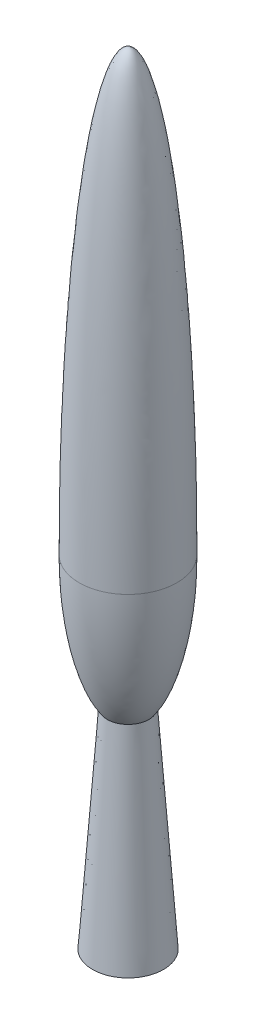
ISO-10303-21;
HEADER;
FILE_DESCRIPTION(('STEP AP214'),'2;1');
FILE_NAME('part.step','',(''),(''),'','','');
FILE_SCHEMA(('AUTOMOTIVE_DESIGN { 1 0 10303 214 1 1 1 1 }'));
ENDSEC;
DATA;
#1=APPLICATION_CONTEXT('core data for automotive mechanical design processes');
#2=APPLICATION_PROTOCOL_DEFINITION('international standard','automotive_design',2000,#1);
#3=PRODUCT_CONTEXT('',#1,'mechanical');
#4=PRODUCT('Part','Part','',(#3));
#5=PRODUCT_RELATED_PRODUCT_CATEGORY('part','',(#4));
#6=PRODUCT_DEFINITION_FORMATION('','',#4);
#7=PRODUCT_DEFINITION_CONTEXT('part definition',#1,'design');
#8=PRODUCT_DEFINITION('design','',#6,#7);
#9=PRODUCT_DEFINITION_SHAPE('','',#8);
#10=(LENGTH_UNIT() NAMED_UNIT(*) SI_UNIT(.MILLI.,.METRE.));
#11=(NAMED_UNIT(*) PLANE_ANGLE_UNIT() SI_UNIT($,.RADIAN.));
#12=(NAMED_UNIT(*) SI_UNIT($,.STERADIAN.) SOLID_ANGLE_UNIT());
#13=UNCERTAINTY_MEASURE_WITH_UNIT(LENGTH_MEASURE(1.E-05),#10,'distance_accuracy_value','');
#14=(GEOMETRIC_REPRESENTATION_CONTEXT(3) GLOBAL_UNCERTAINTY_ASSIGNED_CONTEXT((#13)) GLOBAL_UNIT_ASSIGNED_CONTEXT((#10,
#11,#12)) REPRESENTATION_CONTEXT('',''));
#15=CARTESIAN_POINT('',(0.,0.,0.));
#16=DIRECTION('',(0.,0.,1.));
#17=DIRECTION('',(1.,0.,0.));
#18=AXIS2_PLACEMENT_3D('',#15,#16,#17);
#19=CARTESIAN_POINT('',(0.,0.01,0.));
#20=DIRECTION('',(0.,-1.,0.));
#21=DIRECTION('',(0.,0.,-1.));
#22=AXIS2_PLACEMENT_3D('',#19,#20,#21);
#23=CYLINDRICAL_SURFACE('',#22,1000.);
#24=CARTESIAN_POINT('',(0.,0.01,0.));
#25=DIRECTION('',(0.,1.,0.));
#26=DIRECTION('',(0.,0.,1.));
#27=AXIS2_PLACEMENT_3D('',#24,#25,#26);
#28=CIRCLE('',#27,1000.);
#29=CARTESIAN_POINT('',(0.,0.01,-1000.));
#30=VERTEX_POINT('',#29);
#31=EDGE_CURVE('E11',#30,#30,#28,.T.);
#32=CARTESIAN_POINT('',(0.,0.,0.));
#33=DIRECTION('',(0.,1.,0.));
#34=DIRECTION('',(0.,0.,1.));
#35=AXIS2_PLACEMENT_3D('',#32,#33,#34);
#36=CIRCLE('',#35,1000.);
#37=CARTESIAN_POINT('',(0.,0.,-1000.));
#38=VERTEX_POINT('',#37);
#39=EDGE_CURVE('E41',#38,#38,#36,.T.);
#40=CARTESIAN_POINT('',(0.,0.01,-1000.));
#41=CARTESIAN_POINT('',(0.,0.00989583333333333,-1000.));
#42=CARTESIAN_POINT('',(0.,0.00979166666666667,-1000.));
#43=CARTESIAN_POINT('',(0.,0.00958333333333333,-1000.));
#44=CARTESIAN_POINT('',(0.,0.00947916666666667,-1000.));
#45=CARTESIAN_POINT('',(0.,0.00927083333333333,-1000.));
#46=CARTESIAN_POINT('',(0.,0.00916666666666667,-1000.));
#47=CARTESIAN_POINT('',(0.,0.00895833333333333,-1000.));
#48=CARTESIAN_POINT('',(0.,0.00885416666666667,-1000.));
#49=CARTESIAN_POINT('',(0.,0.00864583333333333,-1000.));
#50=CARTESIAN_POINT('',(0.,0.00854166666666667,-1000.));
#51=CARTESIAN_POINT('',(0.,0.00833333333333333,-1000.));
#52=CARTESIAN_POINT('',(0.,0.00822916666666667,-1000.));
#53=CARTESIAN_POINT('',(0.,0.00802083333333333,-1000.));
#54=CARTESIAN_POINT('',(0.,0.00791666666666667,-1000.));
#55=CARTESIAN_POINT('',(0.,0.00770833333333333,-1000.));
#56=CARTESIAN_POINT('',(0.,0.00760416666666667,-1000.));
#57=CARTESIAN_POINT('',(0.,0.00739583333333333,-1000.));
#58=CARTESIAN_POINT('',(0.,0.00729166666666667,-1000.));
#59=CARTESIAN_POINT('',(0.,0.00708333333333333,-1000.));
#60=CARTESIAN_POINT('',(0.,0.00697916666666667,-1000.));
#61=CARTESIAN_POINT('',(0.,0.00677083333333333,-1000.));
#62=CARTESIAN_POINT('',(0.,0.00666666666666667,-1000.));
#63=CARTESIAN_POINT('',(0.,0.00645833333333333,-1000.));
#64=CARTESIAN_POINT('',(0.,0.00635416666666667,-1000.));
#65=CARTESIAN_POINT('',(0.,0.00614583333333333,-1000.));
#66=CARTESIAN_POINT('',(0.,0.00604166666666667,-1000.));
#67=CARTESIAN_POINT('',(0.,0.00583333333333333,-1000.));
#68=CARTESIAN_POINT('',(0.,0.00572916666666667,-1000.));
#69=CARTESIAN_POINT('',(0.,0.00552083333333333,-1000.));
#70=CARTESIAN_POINT('',(0.,0.00541666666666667,-1000.));
#71=CARTESIAN_POINT('',(0.,0.00520833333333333,-1000.));
#72=CARTESIAN_POINT('',(0.,0.00510416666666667,-1000.));
#73=CARTESIAN_POINT('',(0.,0.00489583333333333,-1000.));
#74=CARTESIAN_POINT('',(0.,0.00479166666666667,-1000.));
#75=CARTESIAN_POINT('',(0.,0.00458333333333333,-1000.));
#76=CARTESIAN_POINT('',(0.,0.00447916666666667,-1000.));
#77=CARTESIAN_POINT('',(0.,0.00427083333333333,-1000.));
#78=CARTESIAN_POINT('',(0.,0.00416666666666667,-1000.));
#79=CARTESIAN_POINT('',(0.,0.00395833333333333,-1000.));
#80=CARTESIAN_POINT('',(0.,0.00385416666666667,-1000.));
#81=CARTESIAN_POINT('',(0.,0.00364583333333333,-1000.));
#82=CARTESIAN_POINT('',(0.,0.00354166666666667,-1000.));
#83=CARTESIAN_POINT('',(0.,0.00333333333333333,-1000.));
#84=CARTESIAN_POINT('',(0.,0.00322916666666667,-1000.));
#85=CARTESIAN_POINT('',(0.,0.00302083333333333,-1000.));
#86=CARTESIAN_POINT('',(0.,0.00291666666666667,-1000.));
#87=CARTESIAN_POINT('',(0.,0.00270833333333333,-1000.));
#88=CARTESIAN_POINT('',(0.,0.00260416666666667,-1000.));
#89=CARTESIAN_POINT('',(0.,0.00239583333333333,-1000.));
#90=CARTESIAN_POINT('',(0.,0.00229166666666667,-1000.));
#91=CARTESIAN_POINT('',(0.,0.00208333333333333,-1000.));
#92=CARTESIAN_POINT('',(0.,0.00197916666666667,-1000.));
#93=CARTESIAN_POINT('',(0.,0.00177083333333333,-1000.));
#94=CARTESIAN_POINT('',(0.,0.00166666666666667,-1000.));
#95=CARTESIAN_POINT('',(0.,0.00145833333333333,-1000.));
#96=CARTESIAN_POINT('',(0.,0.00135416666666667,-1000.));
#97=CARTESIAN_POINT('',(0.,0.00114583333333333,-1000.));
#98=CARTESIAN_POINT('',(0.,0.00104166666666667,-1000.));
#99=CARTESIAN_POINT('',(0.,0.000833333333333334,-1000.));
#100=CARTESIAN_POINT('',(0.,0.000729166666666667,-1000.));
#101=CARTESIAN_POINT('',(0.,0.000520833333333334,-1000.));
#102=CARTESIAN_POINT('',(0.,0.000416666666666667,-1000.));
#103=CARTESIAN_POINT('',(0.,0.000208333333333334,-1000.));
#104=CARTESIAN_POINT('',(0.,0.000104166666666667,-1000.));
#105=CARTESIAN_POINT('',(0.,0.,-1000.));
#106=B_SPLINE_CURVE_WITH_KNOTS('',3,(#40,#41,#42,#43,#44,#45,#46,#47,#48,#49,#50,#51,#52,#53,
#54,#55,#56,#57,#58,#59,#60,#61,#62,#63,#64,#65,#66,#67,#68,#69,#70,#71,#72,#73,#74,#75,#76,#77,
#78,#79,#80,#81,#82,#83,#84,#85,#86,#87,#88,#89,#90,#91,#92,#93,#94,#95,#96,#97,#98,#99,#100,
#101,#102,#103,#104,#105),.UNSPECIFIED.,.F.,.F.,(4,2,2,2,2,2,2,2,2,2,2,2,2,2,2,2,2,2,2,2,2,2,2,
2,2,2,2,2,2,2,2,2,4),(0.,0.000312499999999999,0.000624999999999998,0.000937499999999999,0.00125,
0.0015625,0.001875,0.0021875,0.0025,0.0028125,0.003125,0.0034375,0.00375,0.0040625,0.004375,
0.0046875,0.005,0.0053125,0.005625,0.0059375,0.00625,0.0065625,0.006875,0.0071875,0.0075,
0.0078125,0.008125,0.0084375,0.00875,0.0090625,0.009375,0.0096875,0.01),.UNSPECIFIED.);
#107=EDGE_CURVE('BSEAM33',#30,#38,#106,.T.);
#108=ORIENTED_EDGE('',*,*,#31,.F.);
#109=ORIENTED_EDGE('',*,*,#39,.T.);
#110=ORIENTED_EDGE('',*,*,#107,.T.);
#111=ORIENTED_EDGE('',*,*,#107,.F.);
#112=EDGE_LOOP('',(#108,#110,#109,#111));
#113=FACE_BOUND('',#112,.T.);
#114=ADVANCED_FACE('F33',(#113),#23,.T.);
#115=CARTESIAN_POINT('',(0.,0.01,0.));
#116=DIRECTION('',(1.,0.,0.));
#117=DIRECTION('',(0.,1.,0.));
#118=AXIS2_PLACEMENT_3D('',#115,#116,#117);
#119=ELLIPSE('',#118,9000.,1000.);
#120=TRIMMED_CURVE('',#119,(PARAMETER_VALUE(0.)),(PARAMETER_VALUE(3.14159265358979)),.T.,.PARAMETER.);
#121=CARTESIAN_POINT('',(0.,-8999.99,0.));
#122=DIRECTION('',(0.,1.,0.));
#123=AXIS1_PLACEMENT('',#121,#122);
#124=SURFACE_OF_REVOLUTION('',#120,#123);
#125=CARTESIAN_POINT('',(0.,9000.01,0.));
#126=VERTEX_POINT('',#125);
#127=VERTEX_LOOP('',#126);
#128=FACE_BOUND('',#127,.T.);
#129=ORIENTED_EDGE('',*,*,#31,.T.);
#130=EDGE_LOOP('',(#129));
#131=FACE_BOUND('',#130,.T.);
#132=ADVANCED_FACE('F45',(#128,#131),#124,.F.);
#133=CARTESIAN_POINT('',(0.,0.,0.));
#134=DIRECTION('',(-1.,0.,0.));
#135=DIRECTION('',(0.,-1.,0.));
#136=AXIS2_PLACEMENT_3D('',#133,#134,#135);
#137=ELLIPSE('',#136,3000.,1000.);
#138=TRIMMED_CURVE('',#137,(PARAMETER_VALUE(0.)),(PARAMETER_VALUE(3.14159265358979)),.T.,.PARAMETER.);
#139=CARTESIAN_POINT('',(0.,3000.,0.));
#140=DIRECTION('',(0.,-1.,0.));
#141=AXIS1_PLACEMENT('',#139,#140);
#142=SURFACE_OF_REVOLUTION('',#138,#141);
#143=CARTESIAN_POINT('',(0.,-2712.03993535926,0.));
#144=DIRECTION('',(0.,-1.,0.));
#145=DIRECTION('',(0.,0.,-1.));
#146=AXIS2_PLACEMENT_3D('',#143,#144,#145);
#147=CIRCLE('',#146,427.504306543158);
#148=CARTESIAN_POINT('',(0.,-2712.03993535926,-427.504306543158));
#149=VERTEX_POINT('',#148);
#150=EDGE_CURVE('E38',#149,#149,#147,.F.);
#151=ORIENTED_EDGE('',*,*,#150,.T.);
#152=EDGE_LOOP('',(#151));
#153=FACE_BOUND('',#152,.T.);
#154=ORIENTED_EDGE('',*,*,#39,.F.);
#155=EDGE_LOOP('',(#154));
#156=FACE_BOUND('',#155,.T.);
#157=ADVANCED_FACE('F35',(#153,#156),#142,.F.);
#158=CARTESIAN_POINT('',(0.,0.,0.));
#159=DIRECTION('',(0.,-1.,0.));
#160=DIRECTION('',(0.,0.,1.));
#161=AXIS2_PLACEMENT_3D('',#158,#159,#160);
#162=CONICAL_SURFACE('',#161,237.86,0.0698131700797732);
#163=CARTESIAN_POINT('',(0.,-7000.,0.));
#164=DIRECTION('',(0.,1.,0.));
#165=DIRECTION('',(0.,0.,1.));
#166=AXIS2_PLACEMENT_3D('',#163,#164,#165);
#167=CIRCLE('',#166,727.347683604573);
#168=CARTESIAN_POINT('',(0.,-7000.,727.347683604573));
#169=VERTEX_POINT('',#168);
#170=EDGE_CURVE('E58',#169,#169,#167,.T.);
#171=ORIENTED_EDGE('',*,*,#170,.T.);
#172=EDGE_LOOP('',(#171));
#173=FACE_BOUND('',#172,.T.);
#174=ORIENTED_EDGE('',*,*,#150,.F.);
#175=EDGE_LOOP('',(#174));
#176=FACE_BOUND('',#175,.T.);
#177=ADVANCED_FACE('F64',(#173,#176),#162,.T.);
#178=CARTESIAN_POINT('',(0.,-7000.,0.));
#179=DIRECTION('',(0.,1.,0.));
#180=DIRECTION('',(0.,0.,1.));
#181=AXIS2_PLACEMENT_3D('',#178,#179,#180);
#182=PLANE('',#181);
#183=ORIENTED_EDGE('',*,*,#170,.F.);
#184=EDGE_LOOP('',(#183));
#185=FACE_BOUND('',#184,.T.);
#186=ADVANCED_FACE('F67',(#185),#182,.F.);
#187=CLOSED_SHELL('',(#114,#132,#157,#177,#186));
#188=MANIFOLD_SOLID_BREP('B2',#187);
#189=ADVANCED_BREP_SHAPE_REPRESENTATION('',(#18,#188),#14);
#190=SHAPE_DEFINITION_REPRESENTATION(#9,#189);
ENDSEC;
END-ISO-10303-21;
